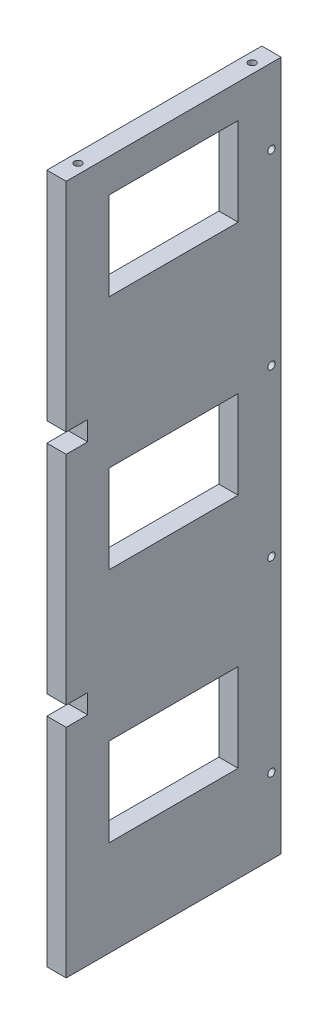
ISO-10303-21;
HEADER;
FILE_DESCRIPTION(('STEP AP214'),'2;1');
FILE_NAME('part.step','',(''),(''),'','','');
FILE_SCHEMA(('AUTOMOTIVE_DESIGN { 1 0 10303 214 1 1 1 1 }'));
ENDSEC;
DATA;
#1=APPLICATION_CONTEXT('core data for automotive mechanical design processes');
#2=APPLICATION_PROTOCOL_DEFINITION('international standard','automotive_design',2000,#1);
#3=PRODUCT_CONTEXT('',#1,'mechanical');
#4=PRODUCT('Part','Part','',(#3));
#5=PRODUCT_RELATED_PRODUCT_CATEGORY('part','',(#4));
#6=PRODUCT_DEFINITION_FORMATION('','',#4);
#7=PRODUCT_DEFINITION_CONTEXT('part definition',#1,'design');
#8=PRODUCT_DEFINITION('design','',#6,#7);
#9=PRODUCT_DEFINITION_SHAPE('','',#8);
#10=(LENGTH_UNIT() NAMED_UNIT(*) SI_UNIT(.MILLI.,.METRE.));
#11=(NAMED_UNIT(*) PLANE_ANGLE_UNIT() SI_UNIT($,.RADIAN.));
#12=(NAMED_UNIT(*) SI_UNIT($,.STERADIAN.) SOLID_ANGLE_UNIT());
#13=UNCERTAINTY_MEASURE_WITH_UNIT(LENGTH_MEASURE(1.E-05),#10,'distance_accuracy_value','');
#14=(GEOMETRIC_REPRESENTATION_CONTEXT(3) GLOBAL_UNCERTAINTY_ASSIGNED_CONTEXT((#13)) GLOBAL_UNIT_ASSIGNED_CONTEXT((#10,
#11,#12)) REPRESENTATION_CONTEXT('',''));
#15=CARTESIAN_POINT('',(0.,0.,0.));
#16=DIRECTION('',(0.,0.,1.));
#17=DIRECTION('',(1.,0.,0.));
#18=AXIS2_PLACEMENT_3D('',#15,#16,#17);
#19=CARTESIAN_POINT('',(-34.9999999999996,8.99999999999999,150.));
#20=DIRECTION('',(0.,0.,-1.));
#21=DIRECTION('',(-1.,0.,0.));
#22=AXIS2_PLACEMENT_3D('',#19,#20,#21);
#23=PLANE('',#22);
#24=DIRECTION('',(0.,-1.,0.));
#25=VECTOR('',#24,1.);
#26=CARTESIAN_POINT('',(-34.9999999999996,8.99999999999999,150.));
#27=LINE('',#26,#25);
#28=CARTESIAN_POINT('',(-34.9999999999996,220.,150.));
#29=VERTEX_POINT('',#28);
#30=CARTESIAN_POINT('',(-34.9999999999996,119.,150.));
#31=VERTEX_POINT('',#30);
#32=EDGE_CURVE('E147',#29,#31,#27,.T.);
#33=ORIENTED_EDGE('',*,*,#32,.F.);
#34=DIRECTION('',(-1.,0.,0.));
#35=VECTOR('',#34,1.);
#36=CARTESIAN_POINT('',(66.0000000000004,220.,149.999999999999));
#37=LINE('',#36,#35);
#38=CARTESIAN_POINT('',(-43.9999999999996,220.,150.));
#39=VERTEX_POINT('',#38);
#40=EDGE_CURVE('E302',#29,#39,#37,.T.);
#41=ORIENTED_EDGE('',*,*,#40,.T.);
#42=DIRECTION('',(0.,-1.,0.));
#43=VECTOR('',#42,1.);
#44=CARTESIAN_POINT('',(-43.9999999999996,8.99999999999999,150.));
#45=LINE('',#44,#43);
#46=CARTESIAN_POINT('',(-43.9999999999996,119.,150.));
#47=VERTEX_POINT('',#46);
#48=EDGE_CURVE('E133',#39,#47,#45,.T.);
#49=ORIENTED_EDGE('',*,*,#48,.T.);
#50=DIRECTION('',(1.,0.,0.));
#51=VECTOR('',#50,1.);
#52=CARTESIAN_POINT('',(-43.9999999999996,119.,150.));
#53=LINE('',#52,#51);
#54=EDGE_CURVE('E290',#47,#31,#53,.T.);
#55=ORIENTED_EDGE('',*,*,#54,.T.);
#56=EDGE_LOOP('',(#33,#41,#49,#55));
#57=FACE_BOUND('',#56,.T.);
#58=ADVANCED_FACE('F35',(#57),#23,.F.);
#59=CARTESIAN_POINT('',(-34.9999999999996,110.,150.));
#60=VERTEX_POINT('',#59);
#61=CARTESIAN_POINT('',(-34.9999999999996,8.99999999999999,150.));
#62=VERTEX_POINT('',#61);
#63=EDGE_CURVE('E148',#60,#62,#27,.T.);
#64=ORIENTED_EDGE('',*,*,#63,.F.);
#65=DIRECTION('',(-1.,0.,0.));
#66=VECTOR('',#65,1.);
#67=CARTESIAN_POINT('',(56.0000000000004,110.,149.999999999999));
#68=LINE('',#67,#66);
#69=CARTESIAN_POINT('',(-43.9999999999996,110.,150.));
#70=VERTEX_POINT('',#69);
#71=EDGE_CURVE('E283',#60,#70,#68,.T.);
#72=ORIENTED_EDGE('',*,*,#71,.T.);
#73=CARTESIAN_POINT('',(-43.9999999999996,8.99999999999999,150.));
#74=VERTEX_POINT('',#73);
#75=EDGE_CURVE('E134',#70,#74,#45,.T.);
#76=ORIENTED_EDGE('',*,*,#75,.T.);
#77=DIRECTION('',(-1.,0.,0.));
#78=VECTOR('',#77,1.);
#79=CARTESIAN_POINT('',(-34.9999999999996,8.99999999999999,150.));
#80=LINE('',#79,#78);
#81=EDGE_CURVE('E119',#62,#74,#80,.T.);
#82=ORIENTED_EDGE('',*,*,#81,.F.);
#83=EDGE_LOOP('',(#64,#72,#76,#82));
#84=FACE_BOUND('',#83,.T.);
#85=ADVANCED_FACE('F534',(#84),#23,.F.);
#86=CARTESIAN_POINT('',(-35.0000000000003,9.,49.9999999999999));
#87=DIRECTION('',(0.,0.,1.));
#88=DIRECTION('',(1.,0.,0.));
#89=AXIS2_PLACEMENT_3D('',#86,#87,#88);
#90=PLANE('',#89);
#91=DIRECTION('',(0.,1.,0.));
#92=VECTOR('',#91,1.);
#93=CARTESIAN_POINT('',(-44.0000000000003,9.,50.));
#94=LINE('',#93,#92);
#95=CARTESIAN_POINT('',(-44.0000000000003,9.,50.));
#96=VERTEX_POINT('',#95);
#97=CARTESIAN_POINT('',(-44.0000000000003,330.,50.));
#98=VERTEX_POINT('',#97);
#99=EDGE_CURVE('E138',#96,#98,#94,.T.);
#100=ORIENTED_EDGE('',*,*,#99,.T.);
#101=DIRECTION('',(-1.,0.,0.));
#102=VECTOR('',#101,1.);
#103=CARTESIAN_POINT('',(-35.0000000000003,330.,49.9999999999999));
#104=LINE('',#103,#102);
#105=CARTESIAN_POINT('',(-35.0000000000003,330.,49.9999999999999));
#106=VERTEX_POINT('',#105);
#107=EDGE_CURVE('E12',#106,#98,#104,.T.);
#108=ORIENTED_EDGE('',*,*,#107,.F.);
#109=DIRECTION('',(0.,1.,0.));
#110=VECTOR('',#109,1.);
#111=CARTESIAN_POINT('',(-35.0000000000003,9.,49.9999999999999));
#112=LINE('',#111,#110);
#113=CARTESIAN_POINT('',(-35.0000000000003,9.,49.9999999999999));
#114=VERTEX_POINT('',#113);
#115=EDGE_CURVE('E129',#114,#106,#112,.T.);
#116=ORIENTED_EDGE('',*,*,#115,.F.);
#117=DIRECTION('',(-1.,0.,0.));
#118=VECTOR('',#117,1.);
#119=CARTESIAN_POINT('',(-35.0000000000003,9.,49.9999999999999));
#120=LINE('',#119,#118);
#121=EDGE_CURVE('E122',#114,#96,#120,.T.);
#122=ORIENTED_EDGE('',*,*,#121,.T.);
#123=EDGE_LOOP('',(#100,#108,#116,#122));
#124=FACE_BOUND('',#123,.T.);
#125=ADVANCED_FACE('F525',(#124),#90,.F.);
#126=CARTESIAN_POINT('',(-35.0000000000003,330.,49.9999999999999));
#127=DIRECTION('',(0.,-1.,0.));
#128=DIRECTION('',(0.,0.,1.));
#129=AXIS2_PLACEMENT_3D('',#126,#127,#128);
#130=PLANE('',#129);
#131=CARTESIAN_POINT('',(-39.4999999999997,330.,140.));
#132=DIRECTION('',(0.,-1.,0.));
#133=DIRECTION('',(0.,0.,1.));
#134=AXIS2_PLACEMENT_3D('',#131,#132,#133);
#135=CIRCLE('',#134,1.69999999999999);
#136=CARTESIAN_POINT('',(-39.4999999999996,330.,141.7));
#137=VERTEX_POINT('',#136);
#138=EDGE_CURVE('E87',#137,#137,#135,.T.);
#139=ORIENTED_EDGE('',*,*,#138,.T.);
#140=EDGE_LOOP('',(#139));
#141=FACE_BOUND('',#140,.T.);
#142=CARTESIAN_POINT('',(-39.5000000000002,330.,59.));
#143=DIRECTION('',(0.,-1.,0.));
#144=DIRECTION('',(0.,0.,1.));
#145=AXIS2_PLACEMENT_3D('',#142,#143,#144);
#146=CIRCLE('',#145,1.69999999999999);
#147=CARTESIAN_POINT('',(-39.5000000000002,330.,60.7));
#148=VERTEX_POINT('',#147);
#149=EDGE_CURVE('E113',#148,#148,#146,.T.);
#150=ORIENTED_EDGE('',*,*,#149,.T.);
#151=EDGE_LOOP('',(#150));
#152=FACE_BOUND('',#151,.T.);
#153=DIRECTION('',(0.,0.,1.));
#154=VECTOR('',#153,1.);
#155=CARTESIAN_POINT('',(-44.0000000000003,330.,50.));
#156=LINE('',#155,#154);
#157=CARTESIAN_POINT('',(-43.9999999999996,330.,150.));
#158=VERTEX_POINT('',#157);
#159=EDGE_CURVE('E135',#98,#158,#156,.T.);
#160=ORIENTED_EDGE('',*,*,#159,.T.);
#161=DIRECTION('',(-1.,0.,0.));
#162=VECTOR('',#161,1.);
#163=CARTESIAN_POINT('',(-34.9999999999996,330.,150.));
#164=LINE('',#163,#162);
#165=CARTESIAN_POINT('',(-34.9999999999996,330.,150.));
#166=VERTEX_POINT('',#165);
#167=EDGE_CURVE('E45',#166,#158,#164,.T.);
#168=ORIENTED_EDGE('',*,*,#167,.F.);
#169=DIRECTION('',(0.,0.,1.));
#170=VECTOR('',#169,1.);
#171=CARTESIAN_POINT('',(-35.0000000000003,330.,49.9999999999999));
#172=LINE('',#171,#170);
#173=EDGE_CURVE('E149',#106,#166,#172,.T.);
#174=ORIENTED_EDGE('',*,*,#173,.F.);
#175=ORIENTED_EDGE('',*,*,#107,.T.);
#176=EDGE_LOOP('',(#160,#168,#174,#175));
#177=FACE_BOUND('',#176,.T.);
#178=ADVANCED_FACE('F519',(#141,#152,#177),#130,.F.);
#179=CARTESIAN_POINT('',(-43.9999999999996,229.,150.));
#180=VERTEX_POINT('',#179);
#181=EDGE_CURVE('E130',#158,#180,#45,.T.);
#182=ORIENTED_EDGE('',*,*,#181,.T.);
#183=DIRECTION('',(1.,0.,0.));
#184=VECTOR('',#183,1.);
#185=CARTESIAN_POINT('',(-43.9999999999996,229.,150.));
#186=LINE('',#185,#184);
#187=CARTESIAN_POINT('',(-34.9999999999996,229.,150.));
#188=VERTEX_POINT('',#187);
#189=EDGE_CURVE('E308',#180,#188,#186,.T.);
#190=ORIENTED_EDGE('',*,*,#189,.T.);
#191=EDGE_CURVE('E144',#166,#188,#27,.T.);
#192=ORIENTED_EDGE('',*,*,#191,.F.);
#193=ORIENTED_EDGE('',*,*,#167,.T.);
#194=EDGE_LOOP('',(#182,#190,#192,#193));
#195=FACE_BOUND('',#194,.T.);
#196=ADVANCED_FACE('F516',(#195),#23,.F.);
#197=CARTESIAN_POINT('',(-35.0000000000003,9.,49.9999999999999));
#198=DIRECTION('',(0.,1.,0.));
#199=DIRECTION('',(0.,0.,-1.));
#200=AXIS2_PLACEMENT_3D('',#197,#198,#199);
#201=PLANE('',#200);
#202=CARTESIAN_POINT('',(-39.5000000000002,9.,59.));
#203=DIRECTION('',(0.,1.,0.));
#204=DIRECTION('',(0.,0.,-1.));
#205=AXIS2_PLACEMENT_3D('',#202,#203,#204);
#206=CIRCLE('',#205,1.69999999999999);
#207=CARTESIAN_POINT('',(-39.5000000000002,9.,57.3));
#208=VERTEX_POINT('',#207);
#209=EDGE_CURVE('E77',#208,#208,#206,.T.);
#210=ORIENTED_EDGE('',*,*,#209,.T.);
#211=EDGE_LOOP('',(#210));
#212=FACE_BOUND('',#211,.T.);
#213=CARTESIAN_POINT('',(-39.4999999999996,8.99999999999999,140.));
#214=DIRECTION('',(0.,1.,0.));
#215=DIRECTION('',(0.,0.,-1.));
#216=AXIS2_PLACEMENT_3D('',#213,#214,#215);
#217=CIRCLE('',#216,1.69999999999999);
#218=CARTESIAN_POINT('',(-39.4999999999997,8.99999999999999,138.3));
#219=VERTEX_POINT('',#218);
#220=EDGE_CURVE('E84',#219,#219,#217,.T.);
#221=ORIENTED_EDGE('',*,*,#220,.T.);
#222=EDGE_LOOP('',(#221));
#223=FACE_BOUND('',#222,.T.);
#224=DIRECTION('',(0.,0.,-1.));
#225=VECTOR('',#224,1.);
#226=CARTESIAN_POINT('',(-44.0000000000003,9.,50.));
#227=LINE('',#226,#225);
#228=EDGE_CURVE('E126',#74,#96,#227,.T.);
#229=ORIENTED_EDGE('',*,*,#228,.T.);
#230=ORIENTED_EDGE('',*,*,#121,.F.);
#231=DIRECTION('',(0.,0.,-1.));
#232=VECTOR('',#231,1.);
#233=CARTESIAN_POINT('',(-35.0000000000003,9.,49.9999999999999));
#234=LINE('',#233,#232);
#235=EDGE_CURVE('E125',#62,#114,#234,.T.);
#236=ORIENTED_EDGE('',*,*,#235,.F.);
#237=ORIENTED_EDGE('',*,*,#81,.T.);
#238=EDGE_LOOP('',(#229,#230,#236,#237));
#239=FACE_BOUND('',#238,.T.);
#240=ADVANCED_FACE('F530',(#212,#223,#239),#201,.F.);
#241=CARTESIAN_POINT('',(-34.9999999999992,0.,200.));
#242=DIRECTION('',(1.,0.,0.));
#243=DIRECTION('',(0.,0.,-1.));
#244=AXIS2_PLACEMENT_3D('',#241,#242,#243);
#245=PLANE('',#244);
#246=CARTESIAN_POINT('',(-35.0000000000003,295.,54.4999999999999));
#247=DIRECTION('',(1.,0.,0.));
#248=DIRECTION('',(0.,0.,-1.));
#249=AXIS2_PLACEMENT_3D('',#246,#247,#248);
#250=CIRCLE('',#249,1.69999999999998);
#251=CARTESIAN_POINT('',(-35.0000000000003,295.,52.8));
#252=VERTEX_POINT('',#251);
#253=EDGE_CURVE('E93',#252,#252,#250,.T.);
#254=ORIENTED_EDGE('',*,*,#253,.F.);
#255=EDGE_LOOP('',(#254));
#256=FACE_BOUND('',#255,.T.);
#257=CARTESIAN_POINT('',(-35.0000000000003,208.,54.4999999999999));
#258=DIRECTION('',(1.,0.,0.));
#259=DIRECTION('',(0.,0.,-1.));
#260=AXIS2_PLACEMENT_3D('',#257,#258,#259);
#261=CIRCLE('',#260,1.70000000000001);
#262=CARTESIAN_POINT('',(-35.0000000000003,208.,52.7999999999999));
#263=VERTEX_POINT('',#262);
#264=EDGE_CURVE('E98',#263,#263,#261,.T.);
#265=ORIENTED_EDGE('',*,*,#264,.F.);
#266=EDGE_LOOP('',(#265));
#267=FACE_BOUND('',#266,.T.);
#268=CARTESIAN_POINT('',(-35.0000000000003,131.,54.4999999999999));
#269=DIRECTION('',(1.,0.,0.));
#270=DIRECTION('',(0.,0.,-1.));
#271=AXIS2_PLACEMENT_3D('',#268,#269,#270);
#272=CIRCLE('',#271,1.69999999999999);
#273=CARTESIAN_POINT('',(-35.0000000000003,131.,52.7999999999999));
#274=VERTEX_POINT('',#273);
#275=EDGE_CURVE('E103',#274,#274,#272,.T.);
#276=ORIENTED_EDGE('',*,*,#275,.F.);
#277=EDGE_LOOP('',(#276));
#278=FACE_BOUND('',#277,.T.);
#279=CARTESIAN_POINT('',(-35.0000000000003,44.,54.4999999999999));
#280=DIRECTION('',(1.,0.,0.));
#281=DIRECTION('',(0.,0.,-1.));
#282=AXIS2_PLACEMENT_3D('',#279,#280,#281);
#283=CIRCLE('',#282,1.69999999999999);
#284=CARTESIAN_POINT('',(-35.0000000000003,44.,52.7999999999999));
#285=VERTEX_POINT('',#284);
#286=EDGE_CURVE('E88',#285,#285,#283,.T.);
#287=ORIENTED_EDGE('',*,*,#286,.F.);
#288=EDGE_LOOP('',(#287));
#289=FACE_BOUND('',#288,.T.);
#290=DIRECTION('',(0.,0.,-1.));
#291=VECTOR('',#290,1.);
#292=CARTESIAN_POINT('',(-34.9999999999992,220.,200.));
#293=LINE('',#292,#291);
#294=CARTESIAN_POINT('',(-34.9999999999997,220.,140.));
#295=VERTEX_POINT('',#294);
#296=EDGE_CURVE('E199',#29,#295,#293,.T.);
#297=ORIENTED_EDGE('',*,*,#296,.F.);
#298=ORIENTED_EDGE('',*,*,#32,.T.);
#299=DIRECTION('',(0.,0.,1.));
#300=VECTOR('',#299,1.);
#301=CARTESIAN_POINT('',(-34.9999999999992,119.,200.));
#302=LINE('',#301,#300);
#303=CARTESIAN_POINT('',(-34.9999999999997,119.,140.));
#304=VERTEX_POINT('',#303);
#305=EDGE_CURVE('E272',#304,#31,#302,.T.);
#306=ORIENTED_EDGE('',*,*,#305,.F.);
#307=DIRECTION('',(0.,1.,0.));
#308=VECTOR('',#307,1.);
#309=CARTESIAN_POINT('',(-34.9999999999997,0.,140.));
#310=LINE('',#309,#308);
#311=CARTESIAN_POINT('',(-34.9999999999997,110.,140.));
#312=VERTEX_POINT('',#311);
#313=EDGE_CURVE('E275',#312,#304,#310,.T.);
#314=ORIENTED_EDGE('',*,*,#313,.F.);
#315=DIRECTION('',(0.,0.,-1.));
#316=VECTOR('',#315,1.);
#317=CARTESIAN_POINT('',(-34.9999999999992,110.,200.));
#318=LINE('',#317,#316);
#319=EDGE_CURVE('E269',#60,#312,#318,.T.);
#320=ORIENTED_EDGE('',*,*,#319,.F.);
#321=ORIENTED_EDGE('',*,*,#63,.T.);
#322=ORIENTED_EDGE('',*,*,#235,.T.);
#323=ORIENTED_EDGE('',*,*,#115,.T.);
#324=ORIENTED_EDGE('',*,*,#173,.T.);
#325=ORIENTED_EDGE('',*,*,#191,.T.);
#326=DIRECTION('',(0.,0.,1.));
#327=VECTOR('',#326,1.);
#328=CARTESIAN_POINT('',(-34.9999999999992,229.,200.));
#329=LINE('',#328,#327);
#330=CARTESIAN_POINT('',(-34.9999999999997,229.,140.));
#331=VERTEX_POINT('',#330);
#332=EDGE_CURVE('E264',#331,#188,#329,.T.);
#333=ORIENTED_EDGE('',*,*,#332,.F.);
#334=DIRECTION('',(0.,1.,0.));
#335=VECTOR('',#334,1.);
#336=CARTESIAN_POINT('',(-34.9999999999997,0.,140.));
#337=LINE('',#336,#335);
#338=EDGE_CURVE('E267',#295,#331,#337,.T.);
#339=ORIENTED_EDGE('',*,*,#338,.F.);
#340=EDGE_LOOP('',(#297,#298,#306,#314,#320,#321,#322,#323,#324,#325,#333,#339));
#341=FACE_BOUND('',#340,.T.);
#342=DIRECTION('',(0.,-1.,0.));
#343=VECTOR('',#342,1.);
#344=CARTESIAN_POINT('',(-34.9999999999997,0.,130.));
#345=LINE('',#344,#343);
#346=CARTESIAN_POINT('',(-34.9999999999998,94.5,130.));
#347=VERTEX_POINT('',#346);
#348=CARTESIAN_POINT('',(-34.9999999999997,53.5,130.));
#349=VERTEX_POINT('',#348);
#350=EDGE_CURVE('E141',#347,#349,#345,.T.);
#351=ORIENTED_EDGE('',*,*,#350,.F.);
#352=DIRECTION('',(0.,0.,1.));
#353=VECTOR('',#352,1.);
#354=CARTESIAN_POINT('',(-34.9999999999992,94.5,200.));
#355=LINE('',#354,#353);
#356=CARTESIAN_POINT('',(-35.0000000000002,94.5,70.));
#357=VERTEX_POINT('',#356);
#358=EDGE_CURVE('E156',#357,#347,#355,.T.);
#359=ORIENTED_EDGE('',*,*,#358,.F.);
#360=DIRECTION('',(0.,1.,0.));
#361=VECTOR('',#360,1.);
#362=CARTESIAN_POINT('',(-35.0000000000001,0.,69.9999999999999));
#363=LINE('',#362,#361);
#364=CARTESIAN_POINT('',(-35.0000000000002,53.5,69.9999999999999));
#365=VERTEX_POINT('',#364);
#366=EDGE_CURVE('E159',#365,#357,#363,.T.);
#367=ORIENTED_EDGE('',*,*,#366,.F.);
#368=DIRECTION('',(0.,0.,-1.));
#369=VECTOR('',#368,1.);
#370=CARTESIAN_POINT('',(-34.9999999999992,53.5,200.));
#371=LINE('',#370,#369);
#372=EDGE_CURVE('E162',#349,#365,#371,.T.);
#373=ORIENTED_EDGE('',*,*,#372,.F.);
#374=EDGE_LOOP('',(#351,#359,#367,#373));
#375=FACE_BOUND('',#374,.T.);
#376=DIRECTION('',(0.,0.,1.));
#377=VECTOR('',#376,1.);
#378=CARTESIAN_POINT('',(-34.9999999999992,204.5,200.));
#379=LINE('',#378,#377);
#380=CARTESIAN_POINT('',(-35.0000000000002,204.5,70.));
#381=VERTEX_POINT('',#380);
#382=CARTESIAN_POINT('',(-34.9999999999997,204.5,130.));
#383=VERTEX_POINT('',#382);
#384=EDGE_CURVE('E165',#381,#383,#379,.T.);
#385=ORIENTED_EDGE('',*,*,#384,.F.);
#386=DIRECTION('',(0.,1.,0.));
#387=VECTOR('',#386,1.);
#388=CARTESIAN_POINT('',(-35.0000000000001,0.,69.9999999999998));
#389=LINE('',#388,#387);
#390=CARTESIAN_POINT('',(-35.0000000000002,163.5,69.9999999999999));
#391=VERTEX_POINT('',#390);
#392=EDGE_CURVE('E168',#391,#381,#389,.T.);
#393=ORIENTED_EDGE('',*,*,#392,.F.);
#394=DIRECTION('',(0.,0.,-1.));
#395=VECTOR('',#394,1.);
#396=CARTESIAN_POINT('',(-34.9999999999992,163.5,200.));
#397=LINE('',#396,#395);
#398=CARTESIAN_POINT('',(-34.9999999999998,163.5,130.));
#399=VERTEX_POINT('',#398);
#400=EDGE_CURVE('E171',#399,#391,#397,.T.);
#401=ORIENTED_EDGE('',*,*,#400,.F.);
#402=DIRECTION('',(0.,-1.,0.));
#403=VECTOR('',#402,1.);
#404=CARTESIAN_POINT('',(-34.9999999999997,0.,130.));
#405=LINE('',#404,#403);
#406=EDGE_CURVE('E174',#383,#399,#405,.T.);
#407=ORIENTED_EDGE('',*,*,#406,.F.);
#408=EDGE_LOOP('',(#385,#393,#401,#407));
#409=FACE_BOUND('',#408,.T.);
#410=DIRECTION('',(0.,0.,1.));
#411=VECTOR('',#410,1.);
#412=CARTESIAN_POINT('',(-34.9999999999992,314.5,200.));
#413=LINE('',#412,#411);
#414=CARTESIAN_POINT('',(-35.0000000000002,314.5,69.9999999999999));
#415=VERTEX_POINT('',#414);
#416=CARTESIAN_POINT('',(-34.9999999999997,314.5,130.));
#417=VERTEX_POINT('',#416);
#418=EDGE_CURVE('E177',#415,#417,#413,.T.);
#419=ORIENTED_EDGE('',*,*,#418,.F.);
#420=DIRECTION('',(0.,1.,0.));
#421=VECTOR('',#420,1.);
#422=CARTESIAN_POINT('',(-35.0000000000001,0.,69.9999999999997));
#423=LINE('',#422,#421);
#424=CARTESIAN_POINT('',(-35.0000000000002,273.5,69.9999999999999));
#425=VERTEX_POINT('',#424);
#426=EDGE_CURVE('E180',#425,#415,#423,.T.);
#427=ORIENTED_EDGE('',*,*,#426,.F.);
#428=DIRECTION('',(0.,0.,-1.));
#429=VECTOR('',#428,1.);
#430=CARTESIAN_POINT('',(-34.9999999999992,273.5,200.));
#431=LINE('',#430,#429);
#432=CARTESIAN_POINT('',(-34.9999999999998,273.5,130.));
#433=VERTEX_POINT('',#432);
#434=EDGE_CURVE('E183',#433,#425,#431,.T.);
#435=ORIENTED_EDGE('',*,*,#434,.F.);
#436=DIRECTION('',(0.,-1.,0.));
#437=VECTOR('',#436,1.);
#438=CARTESIAN_POINT('',(-34.9999999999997,0.,130.));
#439=LINE('',#438,#437);
#440=EDGE_CURVE('E186',#417,#433,#439,.T.);
#441=ORIENTED_EDGE('',*,*,#440,.F.);
#442=EDGE_LOOP('',(#419,#427,#435,#441));
#443=FACE_BOUND('',#442,.T.);
#444=ADVANCED_FACE('F351',(#256,#267,#278,#289,#341,#375,#409,#443),#245,.T.);
#445=CARTESIAN_POINT('',(-43.9999999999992,0.,200.));
#446=DIRECTION('',(1.,0.,0.));
#447=DIRECTION('',(0.,0.,-1.));
#448=AXIS2_PLACEMENT_3D('',#445,#446,#447);
#449=PLANE('',#448);
#450=CARTESIAN_POINT('',(-44.0000000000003,295.,54.5));
#451=DIRECTION('',(-1.,0.,0.));
#452=DIRECTION('',(0.,0.,1.));
#453=AXIS2_PLACEMENT_3D('',#450,#451,#452);
#454=CIRCLE('',#453,3.5);
#455=CARTESIAN_POINT('',(-44.0000000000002,295.,58.));
#456=VERTEX_POINT('',#455);
#457=EDGE_CURVE('E92',#456,#456,#454,.T.);
#458=ORIENTED_EDGE('',*,*,#457,.F.);
#459=EDGE_LOOP('',(#458));
#460=FACE_BOUND('',#459,.T.);
#461=CARTESIAN_POINT('',(-44.0000000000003,208.,54.5));
#462=DIRECTION('',(-1.,0.,0.));
#463=DIRECTION('',(0.,0.,1.));
#464=AXIS2_PLACEMENT_3D('',#461,#462,#463);
#465=CIRCLE('',#464,3.5);
#466=CARTESIAN_POINT('',(-44.0000000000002,208.,58.));
#467=VERTEX_POINT('',#466);
#468=EDGE_CURVE('E96',#467,#467,#465,.T.);
#469=ORIENTED_EDGE('',*,*,#468,.F.);
#470=EDGE_LOOP('',(#469));
#471=FACE_BOUND('',#470,.T.);
#472=CARTESIAN_POINT('',(-44.0000000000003,131.,54.5));
#473=DIRECTION('',(-1.,0.,0.));
#474=DIRECTION('',(0.,0.,1.));
#475=AXIS2_PLACEMENT_3D('',#472,#473,#474);
#476=CIRCLE('',#475,3.5);
#477=CARTESIAN_POINT('',(-44.0000000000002,131.,58.));
#478=VERTEX_POINT('',#477);
#479=EDGE_CURVE('E101',#478,#478,#476,.T.);
#480=ORIENTED_EDGE('',*,*,#479,.F.);
#481=EDGE_LOOP('',(#480));
#482=FACE_BOUND('',#481,.T.);
#483=CARTESIAN_POINT('',(-44.0000000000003,44.,54.5));
#484=DIRECTION('',(-1.,0.,0.));
#485=DIRECTION('',(0.,0.,1.));
#486=AXIS2_PLACEMENT_3D('',#483,#484,#485);
#487=CIRCLE('',#486,3.5);
#488=CARTESIAN_POINT('',(-44.0000000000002,44.,58.));
#489=VERTEX_POINT('',#488);
#490=EDGE_CURVE('E106',#489,#489,#487,.T.);
#491=ORIENTED_EDGE('',*,*,#490,.F.);
#492=EDGE_LOOP('',(#491));
#493=FACE_BOUND('',#492,.T.);
#494=ORIENTED_EDGE('',*,*,#48,.F.);
#495=DIRECTION('',(0.,0.,-1.));
#496=VECTOR('',#495,1.);
#497=CARTESIAN_POINT('',(-43.9999999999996,220.,150.));
#498=LINE('',#497,#496);
#499=CARTESIAN_POINT('',(-43.9999999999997,220.,140.));
#500=VERTEX_POINT('',#499);
#501=EDGE_CURVE('E278',#39,#500,#498,.T.);
#502=ORIENTED_EDGE('',*,*,#501,.T.);
#503=DIRECTION('',(0.,1.,0.));
#504=VECTOR('',#503,1.);
#505=CARTESIAN_POINT('',(-43.9999999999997,220.,140.));
#506=LINE('',#505,#504);
#507=CARTESIAN_POINT('',(-43.9999999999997,229.,140.));
#508=VERTEX_POINT('',#507);
#509=EDGE_CURVE('E286',#500,#508,#506,.T.);
#510=ORIENTED_EDGE('',*,*,#509,.T.);
#511=DIRECTION('',(0.,0.,-1.));
#512=VECTOR('',#511,1.);
#513=CARTESIAN_POINT('',(-43.9999999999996,229.,150.));
#514=LINE('',#513,#512);
#515=EDGE_CURVE('E300',#180,#508,#514,.T.);
#516=ORIENTED_EDGE('',*,*,#515,.F.);
#517=ORIENTED_EDGE('',*,*,#181,.F.);
#518=ORIENTED_EDGE('',*,*,#159,.F.);
#519=ORIENTED_EDGE('',*,*,#99,.F.);
#520=ORIENTED_EDGE('',*,*,#228,.F.);
#521=ORIENTED_EDGE('',*,*,#75,.F.);
#522=DIRECTION('',(0.,0.,-1.));
#523=VECTOR('',#522,1.);
#524=CARTESIAN_POINT('',(-43.9999999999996,110.,150.));
#525=LINE('',#524,#523);
#526=CARTESIAN_POINT('',(-43.9999999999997,110.,140.));
#527=VERTEX_POINT('',#526);
#528=EDGE_CURVE('E282',#70,#527,#525,.T.);
#529=ORIENTED_EDGE('',*,*,#528,.T.);
#530=DIRECTION('',(0.,1.,0.));
#531=VECTOR('',#530,1.);
#532=CARTESIAN_POINT('',(-43.9999999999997,110.,140.));
#533=LINE('',#532,#531);
#534=CARTESIAN_POINT('',(-43.9999999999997,119.,140.));
#535=VERTEX_POINT('',#534);
#536=EDGE_CURVE('E115',#527,#535,#533,.T.);
#537=ORIENTED_EDGE('',*,*,#536,.T.);
#538=DIRECTION('',(0.,0.,-1.));
#539=VECTOR('',#538,1.);
#540=CARTESIAN_POINT('',(-43.9999999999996,119.,150.));
#541=LINE('',#540,#539);
#542=EDGE_CURVE('E279',#47,#535,#541,.T.);
#543=ORIENTED_EDGE('',*,*,#542,.F.);
#544=EDGE_LOOP('',(#494,#502,#510,#516,#517,#518,#519,#520,#521,#529,#537,#543));
#545=FACE_BOUND('',#544,.T.);
#546=DIRECTION('',(0.,0.,-1.));
#547=VECTOR('',#546,1.);
#548=CARTESIAN_POINT('',(-43.9999999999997,94.5,130.));
#549=LINE('',#548,#547);
#550=CARTESIAN_POINT('',(-43.9999999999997,94.5,130.));
#551=VERTEX_POINT('',#550);
#552=CARTESIAN_POINT('',(-44.0000000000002,94.5,70.));
#553=VERTEX_POINT('',#552);
#554=EDGE_CURVE('E257',#551,#553,#549,.T.);
#555=ORIENTED_EDGE('',*,*,#554,.F.);
#556=DIRECTION('',(0.,1.,0.));
#557=VECTOR('',#556,1.);
#558=CARTESIAN_POINT('',(-43.9999999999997,94.5,130.));
#559=LINE('',#558,#557);
#560=CARTESIAN_POINT('',(-43.9999999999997,53.5,130.));
#561=VERTEX_POINT('',#560);
#562=EDGE_CURVE('E242',#561,#551,#559,.T.);
#563=ORIENTED_EDGE('',*,*,#562,.F.);
#564=DIRECTION('',(0.,0.,1.));
#565=VECTOR('',#564,1.);
#566=CARTESIAN_POINT('',(-43.9999999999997,53.5,130.));
#567=LINE('',#566,#565);
#568=CARTESIAN_POINT('',(-44.0000000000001,53.5,70.));
#569=VERTEX_POINT('',#568);
#570=EDGE_CURVE('E189',#569,#561,#567,.T.);
#571=ORIENTED_EDGE('',*,*,#570,.F.);
#572=DIRECTION('',(0.,-1.,0.));
#573=VECTOR('',#572,1.);
#574=CARTESIAN_POINT('',(-44.0000000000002,94.5,70.));
#575=LINE('',#574,#573);
#576=EDGE_CURVE('E254',#553,#569,#575,.T.);
#577=ORIENTED_EDGE('',*,*,#576,.F.);
#578=EDGE_LOOP('',(#555,#563,#571,#577));
#579=FACE_BOUND('',#578,.T.);
#580=DIRECTION('',(0.,-1.,0.));
#581=VECTOR('',#580,1.);
#582=CARTESIAN_POINT('',(-44.0000000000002,204.5,70.));
#583=LINE('',#582,#581);
#584=CARTESIAN_POINT('',(-44.0000000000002,204.5,70.));
#585=VERTEX_POINT('',#584);
#586=CARTESIAN_POINT('',(-44.0000000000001,163.5,70.));
#587=VERTEX_POINT('',#586);
#588=EDGE_CURVE('E235',#585,#587,#583,.T.);
#589=ORIENTED_EDGE('',*,*,#588,.F.);
#590=DIRECTION('',(0.,0.,-1.));
#591=VECTOR('',#590,1.);
#592=CARTESIAN_POINT('',(-43.9999999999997,204.5,130.));
#593=LINE('',#592,#591);
#594=CARTESIAN_POINT('',(-43.9999999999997,204.5,130.));
#595=VERTEX_POINT('',#594);
#596=EDGE_CURVE('E220',#595,#585,#593,.T.);
#597=ORIENTED_EDGE('',*,*,#596,.F.);
#598=DIRECTION('',(0.,1.,0.));
#599=VECTOR('',#598,1.);
#600=CARTESIAN_POINT('',(-43.9999999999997,204.5,130.));
#601=LINE('',#600,#599);
#602=CARTESIAN_POINT('',(-43.9999999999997,163.5,130.));
#603=VERTEX_POINT('',#602);
#604=EDGE_CURVE('E216',#603,#595,#601,.T.);
#605=ORIENTED_EDGE('',*,*,#604,.F.);
#606=DIRECTION('',(0.,0.,1.));
#607=VECTOR('',#606,1.);
#608=CARTESIAN_POINT('',(-43.9999999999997,163.5,130.));
#609=LINE('',#608,#607);
#610=EDGE_CURVE('E232',#587,#603,#609,.T.);
#611=ORIENTED_EDGE('',*,*,#610,.F.);
#612=EDGE_LOOP('',(#589,#597,#605,#611));
#613=FACE_BOUND('',#612,.T.);
#614=DIRECTION('',(0.,-1.,0.));
#615=VECTOR('',#614,1.);
#616=CARTESIAN_POINT('',(-44.0000000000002,314.5,70.));
#617=LINE('',#616,#615);
#618=CARTESIAN_POINT('',(-44.0000000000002,314.5,70.));
#619=VERTEX_POINT('',#618);
#620=CARTESIAN_POINT('',(-44.0000000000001,273.5,70.));
#621=VERTEX_POINT('',#620);
#622=EDGE_CURVE('E211',#619,#621,#617,.T.);
#623=ORIENTED_EDGE('',*,*,#622,.F.);
#624=DIRECTION('',(0.,0.,-1.));
#625=VECTOR('',#624,1.);
#626=CARTESIAN_POINT('',(-43.9999999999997,314.5,130.));
#627=LINE('',#626,#625);
#628=CARTESIAN_POINT('',(-43.9999999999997,314.5,130.));
#629=VERTEX_POINT('',#628);
#630=EDGE_CURVE('E194',#629,#619,#627,.T.);
#631=ORIENTED_EDGE('',*,*,#630,.F.);
#632=DIRECTION('',(0.,1.,0.));
#633=VECTOR('',#632,1.);
#634=CARTESIAN_POINT('',(-43.9999999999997,314.5,130.));
#635=LINE('',#634,#633);
#636=CARTESIAN_POINT('',(-43.9999999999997,273.5,130.));
#637=VERTEX_POINT('',#636);
#638=EDGE_CURVE('E190',#637,#629,#635,.T.);
#639=ORIENTED_EDGE('',*,*,#638,.F.);
#640=DIRECTION('',(0.,0.,1.));
#641=VECTOR('',#640,1.);
#642=CARTESIAN_POINT('',(-43.9999999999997,273.5,130.));
#643=LINE('',#642,#641);
#644=EDGE_CURVE('E208',#621,#637,#643,.T.);
#645=ORIENTED_EDGE('',*,*,#644,.F.);
#646=EDGE_LOOP('',(#623,#631,#639,#645));
#647=FACE_BOUND('',#646,.T.);
#648=ADVANCED_FACE('F347',(#460,#471,#482,#493,#545,#579,#613,#647),#449,.F.);
#649=CARTESIAN_POINT('',(-116.670489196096,314.5,130.));
#650=DIRECTION('',(0.,1.,0.));
#651=DIRECTION('',(0.,0.,-1.));
#652=AXIS2_PLACEMENT_3D('',#649,#650,#651);
#653=PLANE('',#652);
#654=ORIENTED_EDGE('',*,*,#418,.T.);
#655=DIRECTION('',(1.,0.,0.));
#656=VECTOR('',#655,1.);
#657=CARTESIAN_POINT('',(-116.670489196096,314.5,130.));
#658=LINE('',#657,#656);
#659=EDGE_CURVE('E195',#629,#417,#658,.T.);
#660=ORIENTED_EDGE('',*,*,#659,.F.);
#661=ORIENTED_EDGE('',*,*,#630,.T.);
#662=DIRECTION('',(1.,0.,0.));
#663=VECTOR('',#662,1.);
#664=CARTESIAN_POINT('',(-116.670489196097,314.5,70.0000000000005));
#665=LINE('',#664,#663);
#666=EDGE_CURVE('E205',#619,#415,#665,.T.);
#667=ORIENTED_EDGE('',*,*,#666,.T.);
#668=EDGE_LOOP('',(#654,#660,#661,#667));
#669=FACE_BOUND('',#668,.T.);
#670=ADVANCED_FACE('F350',(#669),#653,.F.);
#671=CARTESIAN_POINT('',(-116.670489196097,314.5,70.0000000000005));
#672=DIRECTION('',(0.,0.,-1.));
#673=DIRECTION('',(0.,-1.,0.));
#674=AXIS2_PLACEMENT_3D('',#671,#672,#673);
#675=PLANE('',#674);
#676=ORIENTED_EDGE('',*,*,#426,.T.);
#677=ORIENTED_EDGE('',*,*,#666,.F.);
#678=ORIENTED_EDGE('',*,*,#622,.T.);
#679=DIRECTION('',(1.,0.,0.));
#680=VECTOR('',#679,1.);
#681=CARTESIAN_POINT('',(-116.670489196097,273.5,70.0000000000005));
#682=LINE('',#681,#680);
#683=EDGE_CURVE('E202',#621,#425,#682,.T.);
#684=ORIENTED_EDGE('',*,*,#683,.T.);
#685=EDGE_LOOP('',(#676,#677,#678,#684));
#686=FACE_BOUND('',#685,.T.);
#687=ADVANCED_FACE('F385',(#686),#675,.F.);
#688=CARTESIAN_POINT('',(-116.670489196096,273.5,130.));
#689=DIRECTION('',(0.,-1.,0.));
#690=DIRECTION('',(0.,0.,1.));
#691=AXIS2_PLACEMENT_3D('',#688,#689,#690);
#692=PLANE('',#691);
#693=ORIENTED_EDGE('',*,*,#434,.T.);
#694=ORIENTED_EDGE('',*,*,#683,.F.);
#695=ORIENTED_EDGE('',*,*,#644,.T.);
#696=DIRECTION('',(1.,0.,0.));
#697=VECTOR('',#696,1.);
#698=CARTESIAN_POINT('',(-116.670489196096,273.5,130.));
#699=LINE('',#698,#697);
#700=EDGE_CURVE('E198',#637,#433,#699,.T.);
#701=ORIENTED_EDGE('',*,*,#700,.T.);
#702=EDGE_LOOP('',(#693,#694,#695,#701));
#703=FACE_BOUND('',#702,.T.);
#704=ADVANCED_FACE('F391',(#703),#692,.F.);
#705=CARTESIAN_POINT('',(-116.670489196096,314.5,130.));
#706=DIRECTION('',(0.,0.,1.));
#707=DIRECTION('',(1.,0.,0.));
#708=AXIS2_PLACEMENT_3D('',#705,#706,#707);
#709=PLANE('',#708);
#710=ORIENTED_EDGE('',*,*,#440,.T.);
#711=ORIENTED_EDGE('',*,*,#700,.F.);
#712=ORIENTED_EDGE('',*,*,#638,.T.);
#713=ORIENTED_EDGE('',*,*,#659,.T.);
#714=EDGE_LOOP('',(#710,#711,#712,#713));
#715=FACE_BOUND('',#714,.T.);
#716=ADVANCED_FACE('F902',(#715),#709,.F.);
#717=CARTESIAN_POINT('',(-116.670489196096,204.5,130.000000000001));
#718=DIRECTION('',(0.,1.,0.));
#719=DIRECTION('',(0.,0.,-1.));
#720=AXIS2_PLACEMENT_3D('',#717,#718,#719);
#721=PLANE('',#720);
#722=ORIENTED_EDGE('',*,*,#384,.T.);
#723=DIRECTION('',(1.,0.,0.));
#724=VECTOR('',#723,1.);
#725=CARTESIAN_POINT('',(-116.670489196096,204.5,130.000000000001));
#726=LINE('',#725,#724);
#727=EDGE_CURVE('E193',#595,#383,#726,.T.);
#728=ORIENTED_EDGE('',*,*,#727,.F.);
#729=ORIENTED_EDGE('',*,*,#596,.T.);
#730=DIRECTION('',(1.,0.,0.));
#731=VECTOR('',#730,1.);
#732=CARTESIAN_POINT('',(-116.670489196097,204.5,70.0000000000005));
#733=LINE('',#732,#731);
#734=EDGE_CURVE('E229',#585,#381,#733,.T.);
#735=ORIENTED_EDGE('',*,*,#734,.T.);
#736=EDGE_LOOP('',(#722,#728,#729,#735));
#737=FACE_BOUND('',#736,.T.);
#738=ADVANCED_FACE('F878',(#737),#721,.F.);
#739=CARTESIAN_POINT('',(-116.670489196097,204.5,70.0000000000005));
#740=DIRECTION('',(0.,0.,-1.));
#741=DIRECTION('',(0.,-1.,0.));
#742=AXIS2_PLACEMENT_3D('',#739,#740,#741);
#743=PLANE('',#742);
#744=ORIENTED_EDGE('',*,*,#392,.T.);
#745=ORIENTED_EDGE('',*,*,#734,.F.);
#746=ORIENTED_EDGE('',*,*,#588,.T.);
#747=DIRECTION('',(1.,0.,0.));
#748=VECTOR('',#747,1.);
#749=CARTESIAN_POINT('',(-116.670489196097,163.5,70.0000000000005));
#750=LINE('',#749,#748);
#751=EDGE_CURVE('E226',#587,#391,#750,.T.);
#752=ORIENTED_EDGE('',*,*,#751,.T.);
#753=EDGE_LOOP('',(#744,#745,#746,#752));
#754=FACE_BOUND('',#753,.T.);
#755=ADVANCED_FACE('F871',(#754),#743,.F.);
#756=CARTESIAN_POINT('',(-116.670489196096,163.5,130.000000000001));
#757=DIRECTION('',(0.,-1.,0.));
#758=DIRECTION('',(0.,0.,1.));
#759=AXIS2_PLACEMENT_3D('',#756,#757,#758);
#760=PLANE('',#759);
#761=ORIENTED_EDGE('',*,*,#400,.T.);
#762=ORIENTED_EDGE('',*,*,#751,.F.);
#763=ORIENTED_EDGE('',*,*,#610,.T.);
#764=DIRECTION('',(1.,0.,0.));
#765=VECTOR('',#764,1.);
#766=CARTESIAN_POINT('',(-116.670489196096,163.5,130.000000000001));
#767=LINE('',#766,#765);
#768=EDGE_CURVE('E223',#603,#399,#767,.T.);
#769=ORIENTED_EDGE('',*,*,#768,.T.);
#770=EDGE_LOOP('',(#761,#762,#763,#769));
#771=FACE_BOUND('',#770,.T.);
#772=ADVANCED_FACE('F877',(#771),#760,.F.);
#773=CARTESIAN_POINT('',(-116.670489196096,204.5,130.000000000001));
#774=DIRECTION('',(0.,0.,1.));
#775=DIRECTION('',(1.,0.,0.));
#776=AXIS2_PLACEMENT_3D('',#773,#774,#775);
#777=PLANE('',#776);
#778=ORIENTED_EDGE('',*,*,#406,.T.);
#779=ORIENTED_EDGE('',*,*,#768,.F.);
#780=ORIENTED_EDGE('',*,*,#604,.T.);
#781=ORIENTED_EDGE('',*,*,#727,.T.);
#782=EDGE_LOOP('',(#778,#779,#780,#781));
#783=FACE_BOUND('',#782,.T.);
#784=ADVANCED_FACE('F867',(#783),#777,.F.);
#785=CARTESIAN_POINT('',(-116.670489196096,94.5,130.000000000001));
#786=DIRECTION('',(0.,0.,1.));
#787=DIRECTION('',(1.,0.,0.));
#788=AXIS2_PLACEMENT_3D('',#785,#786,#787);
#789=PLANE('',#788);
#790=ORIENTED_EDGE('',*,*,#350,.T.);
#791=DIRECTION('',(1.,0.,0.));
#792=VECTOR('',#791,1.);
#793=CARTESIAN_POINT('',(-116.670489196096,53.5,130.000000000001));
#794=LINE('',#793,#792);
#795=EDGE_CURVE('E219',#561,#349,#794,.T.);
#796=ORIENTED_EDGE('',*,*,#795,.F.);
#797=ORIENTED_EDGE('',*,*,#562,.T.);
#798=DIRECTION('',(1.,0.,0.));
#799=VECTOR('',#798,1.);
#800=CARTESIAN_POINT('',(-116.670489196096,94.5,130.000000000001));
#801=LINE('',#800,#799);
#802=EDGE_CURVE('E251',#551,#347,#801,.T.);
#803=ORIENTED_EDGE('',*,*,#802,.T.);
#804=EDGE_LOOP('',(#790,#796,#797,#803));
#805=FACE_BOUND('',#804,.T.);
#806=ADVANCED_FACE('F457',(#805),#789,.F.);
#807=CARTESIAN_POINT('',(-116.670489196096,94.5,130.000000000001));
#808=DIRECTION('',(0.,1.,0.));
#809=DIRECTION('',(0.,0.,-1.));
#810=AXIS2_PLACEMENT_3D('',#807,#808,#809);
#811=PLANE('',#810);
#812=ORIENTED_EDGE('',*,*,#358,.T.);
#813=ORIENTED_EDGE('',*,*,#802,.F.);
#814=ORIENTED_EDGE('',*,*,#554,.T.);
#815=DIRECTION('',(1.,0.,0.));
#816=VECTOR('',#815,1.);
#817=CARTESIAN_POINT('',(-116.670489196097,94.5,70.0000000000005));
#818=LINE('',#817,#816);
#819=EDGE_CURVE('E248',#553,#357,#818,.T.);
#820=ORIENTED_EDGE('',*,*,#819,.T.);
#821=EDGE_LOOP('',(#812,#813,#814,#820));
#822=FACE_BOUND('',#821,.T.);
#823=ADVANCED_FACE('F467',(#822),#811,.F.);
#824=CARTESIAN_POINT('',(-116.670489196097,94.5,70.0000000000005));
#825=DIRECTION('',(0.,0.,-1.));
#826=DIRECTION('',(0.,-1.,0.));
#827=AXIS2_PLACEMENT_3D('',#824,#825,#826);
#828=PLANE('',#827);
#829=ORIENTED_EDGE('',*,*,#366,.T.);
#830=ORIENTED_EDGE('',*,*,#819,.F.);
#831=ORIENTED_EDGE('',*,*,#576,.T.);
#832=DIRECTION('',(1.,0.,0.));
#833=VECTOR('',#832,1.);
#834=CARTESIAN_POINT('',(-116.670489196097,53.5,70.0000000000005));
#835=LINE('',#834,#833);
#836=EDGE_CURVE('E245',#569,#365,#835,.T.);
#837=ORIENTED_EDGE('',*,*,#836,.T.);
#838=EDGE_LOOP('',(#829,#830,#831,#837));
#839=FACE_BOUND('',#838,.T.);
#840=ADVANCED_FACE('F465',(#839),#828,.F.);
#841=CARTESIAN_POINT('',(-116.670489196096,53.5,130.000000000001));
#842=DIRECTION('',(0.,-1.,0.));
#843=DIRECTION('',(0.,0.,1.));
#844=AXIS2_PLACEMENT_3D('',#841,#842,#843);
#845=PLANE('',#844);
#846=ORIENTED_EDGE('',*,*,#372,.T.);
#847=ORIENTED_EDGE('',*,*,#836,.F.);
#848=ORIENTED_EDGE('',*,*,#570,.T.);
#849=ORIENTED_EDGE('',*,*,#795,.T.);
#850=EDGE_LOOP('',(#846,#847,#848,#849));
#851=FACE_BOUND('',#850,.T.);
#852=ADVANCED_FACE('F451',(#851),#845,.F.);
#853=CARTESIAN_POINT('',(56.0000000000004,110.,149.999999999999));
#854=DIRECTION('',(0.,-1.,0.));
#855=DIRECTION('',(0.,0.,1.));
#856=AXIS2_PLACEMENT_3D('',#853,#854,#855);
#857=PLANE('',#856);
#858=ORIENTED_EDGE('',*,*,#319,.T.);
#859=DIRECTION('',(-1.,0.,0.));
#860=VECTOR('',#859,1.);
#861=CARTESIAN_POINT('',(56.0000000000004,110.,139.999999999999));
#862=LINE('',#861,#860);
#863=EDGE_CURVE('E287',#312,#527,#862,.T.);
#864=ORIENTED_EDGE('',*,*,#863,.T.);
#865=ORIENTED_EDGE('',*,*,#528,.F.);
#866=ORIENTED_EDGE('',*,*,#71,.F.);
#867=EDGE_LOOP('',(#858,#864,#865,#866));
#868=FACE_BOUND('',#867,.T.);
#869=ADVANCED_FACE('F829',(#868),#857,.F.);
#870=CARTESIAN_POINT('',(-43.9999999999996,119.,150.));
#871=DIRECTION('',(0.,1.,0.));
#872=DIRECTION('',(0.,0.,-1.));
#873=AXIS2_PLACEMENT_3D('',#870,#871,#872);
#874=PLANE('',#873);
#875=ORIENTED_EDGE('',*,*,#305,.T.);
#876=ORIENTED_EDGE('',*,*,#54,.F.);
#877=ORIENTED_EDGE('',*,*,#542,.T.);
#878=DIRECTION('',(1.,0.,0.));
#879=VECTOR('',#878,1.);
#880=CARTESIAN_POINT('',(-43.9999999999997,119.,140.));
#881=LINE('',#880,#879);
#882=EDGE_CURVE('E291',#535,#304,#881,.T.);
#883=ORIENTED_EDGE('',*,*,#882,.T.);
#884=EDGE_LOOP('',(#875,#876,#877,#883));
#885=FACE_BOUND('',#884,.T.);
#886=ADVANCED_FACE('F815',(#885),#874,.F.);
#887=CARTESIAN_POINT('',(-78.9999999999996,0.,140.));
#888=DIRECTION('',(0.,0.,-1.));
#889=DIRECTION('',(-1.,0.,0.));
#890=AXIS2_PLACEMENT_3D('',#887,#888,#889);
#891=PLANE('',#890);
#892=ORIENTED_EDGE('',*,*,#313,.T.);
#893=ORIENTED_EDGE('',*,*,#882,.F.);
#894=ORIENTED_EDGE('',*,*,#536,.F.);
#895=ORIENTED_EDGE('',*,*,#863,.F.);
#896=EDGE_LOOP('',(#892,#893,#894,#895));
#897=FACE_BOUND('',#896,.T.);
#898=ADVANCED_FACE('F809',(#897),#891,.F.);
#899=CARTESIAN_POINT('',(66.0000000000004,220.,149.999999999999));
#900=DIRECTION('',(0.,-1.,0.));
#901=DIRECTION('',(0.,0.,1.));
#902=AXIS2_PLACEMENT_3D('',#899,#900,#901);
#903=PLANE('',#902);
#904=ORIENTED_EDGE('',*,*,#296,.T.);
#905=DIRECTION('',(-1.,0.,0.));
#906=VECTOR('',#905,1.);
#907=CARTESIAN_POINT('',(66.0000000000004,220.,139.999999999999));
#908=LINE('',#907,#906);
#909=EDGE_CURVE('E305',#295,#500,#908,.T.);
#910=ORIENTED_EDGE('',*,*,#909,.T.);
#911=ORIENTED_EDGE('',*,*,#501,.F.);
#912=ORIENTED_EDGE('',*,*,#40,.F.);
#913=EDGE_LOOP('',(#904,#910,#911,#912));
#914=FACE_BOUND('',#913,.T.);
#915=ADVANCED_FACE('F540',(#914),#903,.F.);
#916=CARTESIAN_POINT('',(-43.9999999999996,229.,150.));
#917=DIRECTION('',(0.,1.,0.));
#918=DIRECTION('',(0.,0.,-1.));
#919=AXIS2_PLACEMENT_3D('',#916,#917,#918);
#920=PLANE('',#919);
#921=ORIENTED_EDGE('',*,*,#332,.T.);
#922=ORIENTED_EDGE('',*,*,#189,.F.);
#923=ORIENTED_EDGE('',*,*,#515,.T.);
#924=DIRECTION('',(1.,0.,0.));
#925=VECTOR('',#924,1.);
#926=CARTESIAN_POINT('',(-43.9999999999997,229.,140.));
#927=LINE('',#926,#925);
#928=EDGE_CURVE('E54',#508,#331,#927,.T.);
#929=ORIENTED_EDGE('',*,*,#928,.T.);
#930=EDGE_LOOP('',(#921,#922,#923,#929));
#931=FACE_BOUND('',#930,.T.);
#932=ADVANCED_FACE('F512',(#931),#920,.F.);
#933=CARTESIAN_POINT('',(-78.9999999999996,0.,140.));
#934=DIRECTION('',(0.,0.,-1.));
#935=DIRECTION('',(-1.,0.,0.));
#936=AXIS2_PLACEMENT_3D('',#933,#934,#935);
#937=PLANE('',#936);
#938=ORIENTED_EDGE('',*,*,#338,.T.);
#939=ORIENTED_EDGE('',*,*,#928,.F.);
#940=ORIENTED_EDGE('',*,*,#509,.F.);
#941=ORIENTED_EDGE('',*,*,#909,.F.);
#942=EDGE_LOOP('',(#938,#939,#940,#941));
#943=FACE_BOUND('',#942,.T.);
#944=ADVANCED_FACE('F545',(#943),#937,.F.);
#945=CARTESIAN_POINT('',(-39.5000000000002,339.,59.));
#946=DIRECTION('',(0.,1.,0.));
#947=DIRECTION('',(0.,0.,-1.));
#948=AXIS2_PLACEMENT_3D('',#945,#946,#947);
#949=CYLINDRICAL_SURFACE('',#948,1.69999999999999);
#950=CARTESIAN_POINT('',(-39.5000000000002,317.874975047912,59.));
#951=DIRECTION('',(0.,1.,0.));
#952=DIRECTION('',(0.,0.,1.));
#953=AXIS2_PLACEMENT_3D('',#950,#951,#952);
#954=CIRCLE('',#953,1.69999999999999);
#955=CARTESIAN_POINT('',(-39.5000000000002,317.874975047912,60.7));
#956=VERTEX_POINT('',#955);
#957=EDGE_CURVE('E39',#956,#956,#954,.T.);
#958=ORIENTED_EDGE('',*,*,#957,.F.);
#959=EDGE_LOOP('',(#958));
#960=FACE_BOUND('',#959,.T.);
#961=ORIENTED_EDGE('',*,*,#149,.F.);
#962=EDGE_LOOP('',(#961));
#963=FACE_BOUND('',#962,.T.);
#964=ADVANCED_FACE('F547',(#960,#963),#949,.F.);
#965=CARTESIAN_POINT('',(-39.5000000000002,317.642875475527,59.));
#966=DIRECTION('',(0.,1.,0.));
#967=DIRECTION('',(0.,0.,-1.));
#968=AXIS2_PLACEMENT_3D('',#965,#966,#967);
#969=CONICAL_SURFACE('',#968,1.31372144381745,1.02974425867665);
#970=CARTESIAN_POINT('',(-39.5000000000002,316.853511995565,59.));
#971=VERTEX_POINT('',#970);
#972=VERTEX_LOOP('',#971);
#973=FACE_BOUND('',#972,.T.);
#974=ORIENTED_EDGE('',*,*,#957,.T.);
#975=EDGE_LOOP('',(#974));
#976=FACE_BOUND('',#975,.T.);
#977=ADVANCED_FACE('F553',(#973,#976),#969,.F.);
#978=CARTESIAN_POINT('',(-39.4999999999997,339.,140.));
#979=DIRECTION('',(0.,1.,0.));
#980=DIRECTION('',(0.,0.,-1.));
#981=AXIS2_PLACEMENT_3D('',#978,#979,#980);
#982=CYLINDRICAL_SURFACE('',#981,1.69999999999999);
#983=CARTESIAN_POINT('',(-39.4999999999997,317.874975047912,140.));
#984=DIRECTION('',(0.,1.,0.));
#985=DIRECTION('',(0.,0.,1.));
#986=AXIS2_PLACEMENT_3D('',#983,#984,#985);
#987=CIRCLE('',#986,1.69999999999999);
#988=CARTESIAN_POINT('',(-39.4999999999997,317.874975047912,141.7));
#989=VERTEX_POINT('',#988);
#990=EDGE_CURVE('E85',#989,#989,#987,.T.);
#991=ORIENTED_EDGE('',*,*,#990,.F.);
#992=EDGE_LOOP('',(#991));
#993=FACE_BOUND('',#992,.T.);
#994=ORIENTED_EDGE('',*,*,#138,.F.);
#995=EDGE_LOOP('',(#994));
#996=FACE_BOUND('',#995,.T.);
#997=ADVANCED_FACE('F582',(#993,#996),#982,.F.);
#998=CARTESIAN_POINT('',(-39.4999999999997,317.642875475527,140.));
#999=DIRECTION('',(0.,1.,0.));
#1000=DIRECTION('',(0.,0.,-1.));
#1001=AXIS2_PLACEMENT_3D('',#998,#999,#1000);
#1002=CONICAL_SURFACE('',#1001,1.31372144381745,1.02974425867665);
#1003=CARTESIAN_POINT('',(-39.4999999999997,316.853511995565,140.));
#1004=VERTEX_POINT('',#1003);
#1005=VERTEX_LOOP('',#1004);
#1006=FACE_BOUND('',#1005,.T.);
#1007=ORIENTED_EDGE('',*,*,#990,.T.);
#1008=EDGE_LOOP('',(#1007));
#1009=FACE_BOUND('',#1008,.T.);
#1010=ADVANCED_FACE('F578',(#1006,#1009),#1002,.F.);
#1011=CARTESIAN_POINT('',(-44.0000000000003,44.,54.5));
#1012=DIRECTION('',(-1.,0.,0.));
#1013=DIRECTION('',(0.,0.,1.));
#1014=AXIS2_PLACEMENT_3D('',#1011,#1012,#1013);
#1015=CYLINDRICAL_SURFACE('',#1014,1.69999999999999);
#1016=ORIENTED_EDGE('',*,*,#286,.T.);
#1017=EDGE_LOOP('',(#1016));
#1018=FACE_BOUND('',#1017,.T.);
#1019=CARTESIAN_POINT('',(-41.6000000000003,44.,54.5));
#1020=DIRECTION('',(-1.,0.,0.));
#1021=DIRECTION('',(0.,0.,1.));
#1022=AXIS2_PLACEMENT_3D('',#1019,#1020,#1021);
#1023=CIRCLE('',#1022,1.69999999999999);
#1024=CARTESIAN_POINT('',(-41.6000000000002,44.,56.2));
#1025=VERTEX_POINT('',#1024);
#1026=EDGE_CURVE('E110',#1025,#1025,#1023,.T.);
#1027=ORIENTED_EDGE('',*,*,#1026,.T.);
#1028=EDGE_LOOP('',(#1027));
#1029=FACE_BOUND('',#1028,.T.);
#1030=ADVANCED_FACE('F581',(#1018,#1029),#1015,.F.);
#1031=CARTESIAN_POINT('',(-41.6000000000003,45.7,54.5));
#1032=DIRECTION('',(1.,0.,0.));
#1033=DIRECTION('',(0.,0.,-1.));
#1034=AXIS2_PLACEMENT_3D('',#1031,#1032,#1033);
#1035=PLANE('',#1034);
#1036=ORIENTED_EDGE('',*,*,#1026,.F.);
#1037=EDGE_LOOP('',(#1036));
#1038=FACE_BOUND('',#1037,.T.);
#1039=CARTESIAN_POINT('',(-41.6000000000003,44.,54.5));
#1040=DIRECTION('',(-1.,0.,0.));
#1041=DIRECTION('',(0.,0.,1.));
#1042=AXIS2_PLACEMENT_3D('',#1039,#1040,#1041);
#1043=CIRCLE('',#1042,3.5);
#1044=CARTESIAN_POINT('',(-41.6000000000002,44.,58.));
#1045=VERTEX_POINT('',#1044);
#1046=EDGE_CURVE('E318',#1045,#1045,#1043,.T.);
#1047=ORIENTED_EDGE('',*,*,#1046,.T.);
#1048=EDGE_LOOP('',(#1047));
#1049=FACE_BOUND('',#1048,.T.);
#1050=ADVANCED_FACE('F604',(#1038,#1049),#1035,.F.);
#1051=CARTESIAN_POINT('',(-44.0000000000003,44.,54.5));
#1052=DIRECTION('',(-1.,0.,0.));
#1053=DIRECTION('',(0.,0.,1.));
#1054=AXIS2_PLACEMENT_3D('',#1051,#1052,#1053);
#1055=CYLINDRICAL_SURFACE('',#1054,3.5);
#1056=ORIENTED_EDGE('',*,*,#1046,.F.);
#1057=EDGE_LOOP('',(#1056));
#1058=FACE_BOUND('',#1057,.T.);
#1059=ORIENTED_EDGE('',*,*,#490,.T.);
#1060=EDGE_LOOP('',(#1059));
#1061=FACE_BOUND('',#1060,.T.);
#1062=ADVANCED_FACE('F608',(#1058,#1061),#1055,.F.);
#1063=CARTESIAN_POINT('',(-44.0000000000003,131.,54.5));
#1064=DIRECTION('',(-1.,0.,0.));
#1065=DIRECTION('',(0.,0.,1.));
#1066=AXIS2_PLACEMENT_3D('',#1063,#1064,#1065);
#1067=CYLINDRICAL_SURFACE('',#1066,1.69999999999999);
#1068=ORIENTED_EDGE('',*,*,#275,.T.);
#1069=EDGE_LOOP('',(#1068));
#1070=FACE_BOUND('',#1069,.T.);
#1071=CARTESIAN_POINT('',(-41.6000000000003,131.,54.5));
#1072=DIRECTION('',(-1.,0.,0.));
#1073=DIRECTION('',(0.,0.,1.));
#1074=AXIS2_PLACEMENT_3D('',#1071,#1072,#1073);
#1075=CIRCLE('',#1074,1.70000000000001);
#1076=CARTESIAN_POINT('',(-41.6000000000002,131.,56.2));
#1077=VERTEX_POINT('',#1076);
#1078=EDGE_CURVE('E107',#1077,#1077,#1075,.T.);
#1079=ORIENTED_EDGE('',*,*,#1078,.T.);
#1080=EDGE_LOOP('',(#1079));
#1081=FACE_BOUND('',#1080,.T.);
#1082=ADVANCED_FACE('F612',(#1070,#1081),#1067,.F.);
#1083=CARTESIAN_POINT('',(-41.6000000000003,132.7,54.5));
#1084=DIRECTION('',(1.,0.,0.));
#1085=DIRECTION('',(0.,0.,-1.));
#1086=AXIS2_PLACEMENT_3D('',#1083,#1084,#1085);
#1087=PLANE('',#1086);
#1088=ORIENTED_EDGE('',*,*,#1078,.F.);
#1089=EDGE_LOOP('',(#1088));
#1090=FACE_BOUND('',#1089,.T.);
#1091=CARTESIAN_POINT('',(-41.6000000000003,131.,54.5));
#1092=DIRECTION('',(-1.,0.,0.));
#1093=DIRECTION('',(0.,0.,1.));
#1094=AXIS2_PLACEMENT_3D('',#1091,#1092,#1093);
#1095=CIRCLE('',#1094,3.5);
#1096=CARTESIAN_POINT('',(-41.6000000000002,131.,58.));
#1097=VERTEX_POINT('',#1096);
#1098=EDGE_CURVE('E325',#1097,#1097,#1095,.T.);
#1099=ORIENTED_EDGE('',*,*,#1098,.T.);
#1100=EDGE_LOOP('',(#1099));
#1101=FACE_BOUND('',#1100,.T.);
#1102=ADVANCED_FACE('F616',(#1090,#1101),#1087,.F.);
#1103=CARTESIAN_POINT('',(-44.0000000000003,131.,54.5));
#1104=DIRECTION('',(-1.,0.,0.));
#1105=DIRECTION('',(0.,0.,1.));
#1106=AXIS2_PLACEMENT_3D('',#1103,#1104,#1105);
#1107=CYLINDRICAL_SURFACE('',#1106,3.5);
#1108=ORIENTED_EDGE('',*,*,#1098,.F.);
#1109=EDGE_LOOP('',(#1108));
#1110=FACE_BOUND('',#1109,.T.);
#1111=ORIENTED_EDGE('',*,*,#479,.T.);
#1112=EDGE_LOOP('',(#1111));
#1113=FACE_BOUND('',#1112,.T.);
#1114=ADVANCED_FACE('F620',(#1110,#1113),#1107,.F.);
#1115=CARTESIAN_POINT('',(-44.0000000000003,208.,54.5));
#1116=DIRECTION('',(-1.,0.,0.));
#1117=DIRECTION('',(0.,0.,1.));
#1118=AXIS2_PLACEMENT_3D('',#1115,#1116,#1117);
#1119=CYLINDRICAL_SURFACE('',#1118,1.70000000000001);
#1120=ORIENTED_EDGE('',*,*,#264,.T.);
#1121=EDGE_LOOP('',(#1120));
#1122=FACE_BOUND('',#1121,.T.);
#1123=CARTESIAN_POINT('',(-41.6000000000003,208.,54.5));
#1124=DIRECTION('',(-1.,0.,0.));
#1125=DIRECTION('',(0.,0.,1.));
#1126=AXIS2_PLACEMENT_3D('',#1123,#1124,#1125);
#1127=CIRCLE('',#1126,1.70000000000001);
#1128=CARTESIAN_POINT('',(-41.6000000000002,208.,56.2));
#1129=VERTEX_POINT('',#1128);
#1130=EDGE_CURVE('E102',#1129,#1129,#1127,.T.);
#1131=ORIENTED_EDGE('',*,*,#1130,.T.);
#1132=EDGE_LOOP('',(#1131));
#1133=FACE_BOUND('',#1132,.T.);
#1134=ADVANCED_FACE('F624',(#1122,#1133),#1119,.F.);
#1135=CARTESIAN_POINT('',(-41.6000000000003,209.7,54.5));
#1136=DIRECTION('',(1.,0.,0.));
#1137=DIRECTION('',(0.,0.,-1.));
#1138=AXIS2_PLACEMENT_3D('',#1135,#1136,#1137);
#1139=PLANE('',#1138);
#1140=ORIENTED_EDGE('',*,*,#1130,.F.);
#1141=EDGE_LOOP('',(#1140));
#1142=FACE_BOUND('',#1141,.T.);
#1143=CARTESIAN_POINT('',(-41.6000000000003,208.,54.5));
#1144=DIRECTION('',(-1.,0.,0.));
#1145=DIRECTION('',(0.,0.,1.));
#1146=AXIS2_PLACEMENT_3D('',#1143,#1144,#1145);
#1147=CIRCLE('',#1146,3.5);
#1148=CARTESIAN_POINT('',(-41.6000000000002,208.,58.));
#1149=VERTEX_POINT('',#1148);
#1150=EDGE_CURVE('E332',#1149,#1149,#1147,.T.);
#1151=ORIENTED_EDGE('',*,*,#1150,.T.);
#1152=EDGE_LOOP('',(#1151));
#1153=FACE_BOUND('',#1152,.T.);
#1154=ADVANCED_FACE('F628',(#1142,#1153),#1139,.F.);
#1155=CARTESIAN_POINT('',(-44.0000000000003,208.,54.5));
#1156=DIRECTION('',(-1.,0.,0.));
#1157=DIRECTION('',(0.,0.,1.));
#1158=AXIS2_PLACEMENT_3D('',#1155,#1156,#1157);
#1159=CYLINDRICAL_SURFACE('',#1158,3.5);
#1160=ORIENTED_EDGE('',*,*,#1150,.F.);
#1161=EDGE_LOOP('',(#1160));
#1162=FACE_BOUND('',#1161,.T.);
#1163=ORIENTED_EDGE('',*,*,#468,.T.);
#1164=EDGE_LOOP('',(#1163));
#1165=FACE_BOUND('',#1164,.T.);
#1166=ADVANCED_FACE('F632',(#1162,#1165),#1159,.F.);
#1167=CARTESIAN_POINT('',(-44.0000000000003,295.,54.5));
#1168=DIRECTION('',(-1.,0.,0.));
#1169=DIRECTION('',(0.,0.,1.));
#1170=AXIS2_PLACEMENT_3D('',#1167,#1168,#1169);
#1171=CYLINDRICAL_SURFACE('',#1170,1.69999999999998);
#1172=ORIENTED_EDGE('',*,*,#253,.T.);
#1173=EDGE_LOOP('',(#1172));
#1174=FACE_BOUND('',#1173,.T.);
#1175=CARTESIAN_POINT('',(-41.6000000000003,295.,54.5));
#1176=DIRECTION('',(-1.,0.,0.));
#1177=DIRECTION('',(0.,0.,1.));
#1178=AXIS2_PLACEMENT_3D('',#1175,#1176,#1177);
#1179=CIRCLE('',#1178,1.69999999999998);
#1180=CARTESIAN_POINT('',(-41.6000000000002,295.,56.2));
#1181=VERTEX_POINT('',#1180);
#1182=EDGE_CURVE('E97',#1181,#1181,#1179,.T.);
#1183=ORIENTED_EDGE('',*,*,#1182,.T.);
#1184=EDGE_LOOP('',(#1183));
#1185=FACE_BOUND('',#1184,.T.);
#1186=ADVANCED_FACE('F636',(#1174,#1185),#1171,.F.);
#1187=CARTESIAN_POINT('',(-41.6000000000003,296.7,54.5));
#1188=DIRECTION('',(1.,0.,0.));
#1189=DIRECTION('',(0.,0.,-1.));
#1190=AXIS2_PLACEMENT_3D('',#1187,#1188,#1189);
#1191=PLANE('',#1190);
#1192=ORIENTED_EDGE('',*,*,#1182,.F.);
#1193=EDGE_LOOP('',(#1192));
#1194=FACE_BOUND('',#1193,.T.);
#1195=CARTESIAN_POINT('',(-41.6000000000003,295.,54.5));
#1196=DIRECTION('',(-1.,0.,0.));
#1197=DIRECTION('',(0.,0.,1.));
#1198=AXIS2_PLACEMENT_3D('',#1195,#1196,#1197);
#1199=CIRCLE('',#1198,3.5);
#1200=CARTESIAN_POINT('',(-41.6000000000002,295.,58.));
#1201=VERTEX_POINT('',#1200);
#1202=EDGE_CURVE('E339',#1201,#1201,#1199,.T.);
#1203=ORIENTED_EDGE('',*,*,#1202,.T.);
#1204=EDGE_LOOP('',(#1203));
#1205=FACE_BOUND('',#1204,.T.);
#1206=ADVANCED_FACE('F640',(#1194,#1205),#1191,.F.);
#1207=CARTESIAN_POINT('',(-44.0000000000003,295.,54.5));
#1208=DIRECTION('',(-1.,0.,0.));
#1209=DIRECTION('',(0.,0.,1.));
#1210=AXIS2_PLACEMENT_3D('',#1207,#1208,#1209);
#1211=CYLINDRICAL_SURFACE('',#1210,3.5);
#1212=ORIENTED_EDGE('',*,*,#1202,.F.);
#1213=EDGE_LOOP('',(#1212));
#1214=FACE_BOUND('',#1213,.T.);
#1215=ORIENTED_EDGE('',*,*,#457,.T.);
#1216=EDGE_LOOP('',(#1215));
#1217=FACE_BOUND('',#1216,.T.);
#1218=ADVANCED_FACE('F345',(#1214,#1217),#1211,.F.);
#1219=CARTESIAN_POINT('',(-39.4999999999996,0.,140.));
#1220=DIRECTION('',(0.,-1.,0.));
#1221=DIRECTION('',(0.,0.,1.));
#1222=AXIS2_PLACEMENT_3D('',#1219,#1220,#1221);
#1223=CYLINDRICAL_SURFACE('',#1222,1.69999999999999);
#1224=CARTESIAN_POINT('',(-39.4999999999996,21.1250249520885,140.));
#1225=DIRECTION('',(0.,-1.,0.));
#1226=DIRECTION('',(0.,0.,-1.));
#1227=AXIS2_PLACEMENT_3D('',#1224,#1225,#1226);
#1228=CIRCLE('',#1227,1.69999999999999);
#1229=CARTESIAN_POINT('',(-39.4999999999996,21.1250249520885,138.3));
#1230=VERTEX_POINT('',#1229);
#1231=EDGE_CURVE('E79',#1230,#1230,#1228,.T.);
#1232=ORIENTED_EDGE('',*,*,#1231,.F.);
#1233=EDGE_LOOP('',(#1232));
#1234=FACE_BOUND('',#1233,.T.);
#1235=ORIENTED_EDGE('',*,*,#220,.F.);
#1236=EDGE_LOOP('',(#1235));
#1237=FACE_BOUND('',#1236,.T.);
#1238=ADVANCED_FACE('F647',(#1234,#1237),#1223,.F.);
#1239=CARTESIAN_POINT('',(-39.4999999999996,21.3571245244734,140.));
#1240=DIRECTION('',(0.,-1.,0.));
#1241=DIRECTION('',(0.,0.,1.));
#1242=AXIS2_PLACEMENT_3D('',#1239,#1240,#1241);
#1243=CONICAL_SURFACE('',#1242,1.31372144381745,1.02974425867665);
#1244=CARTESIAN_POINT('',(-39.4999999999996,22.1464880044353,140.));
#1245=VERTEX_POINT('',#1244);
#1246=VERTEX_LOOP('',#1245);
#1247=FACE_BOUND('',#1246,.T.);
#1248=ORIENTED_EDGE('',*,*,#1231,.T.);
#1249=EDGE_LOOP('',(#1248));
#1250=FACE_BOUND('',#1249,.T.);
#1251=ADVANCED_FACE('F37',(#1247,#1250),#1243,.F.);
#1252=CARTESIAN_POINT('',(-39.5000000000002,0.,59.));
#1253=DIRECTION('',(0.,-1.,0.));
#1254=DIRECTION('',(0.,0.,1.));
#1255=AXIS2_PLACEMENT_3D('',#1252,#1253,#1254);
#1256=CYLINDRICAL_SURFACE('',#1255,1.69999999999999);
#1257=CARTESIAN_POINT('',(-39.5000000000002,21.1250249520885,59.));
#1258=DIRECTION('',(0.,-1.,0.));
#1259=DIRECTION('',(0.,0.,-1.));
#1260=AXIS2_PLACEMENT_3D('',#1257,#1258,#1259);
#1261=CIRCLE('',#1260,1.69999999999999);
#1262=CARTESIAN_POINT('',(-39.5000000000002,21.1250249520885,57.3));
#1263=VERTEX_POINT('',#1262);
#1264=EDGE_CURVE('E75',#1263,#1263,#1261,.T.);
#1265=ORIENTED_EDGE('',*,*,#1264,.F.);
#1266=EDGE_LOOP('',(#1265));
#1267=FACE_BOUND('',#1266,.T.);
#1268=ORIENTED_EDGE('',*,*,#209,.F.);
#1269=EDGE_LOOP('',(#1268));
#1270=FACE_BOUND('',#1269,.T.);
#1271=ADVANCED_FACE('F72',(#1267,#1270),#1256,.F.);
#1272=CARTESIAN_POINT('',(-39.5000000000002,21.3571245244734,59.));
#1273=DIRECTION('',(0.,-1.,0.));
#1274=DIRECTION('',(0.,0.,1.));
#1275=AXIS2_PLACEMENT_3D('',#1272,#1273,#1274);
#1276=CONICAL_SURFACE('',#1275,1.31372144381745,1.02974425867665);
#1277=CARTESIAN_POINT('',(-39.5000000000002,22.1464880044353,59.));
#1278=VERTEX_POINT('',#1277);
#1279=VERTEX_LOOP('',#1278);
#1280=FACE_BOUND('',#1279,.T.);
#1281=ORIENTED_EDGE('',*,*,#1264,.T.);
#1282=EDGE_LOOP('',(#1281));
#1283=FACE_BOUND('',#1282,.T.);
#1284=ADVANCED_FACE('F69',(#1280,#1283),#1276,.F.);
#1285=CLOSED_SHELL('',(#58,#85,#125,#178,#196,#240,#444,#648,#670,#687,#704,#716,#738,#755,#772,
#784,#806,#823,#840,#852,#869,#886,#898,#915,#932,#944,#964,#977,#997,#1010,#1030,#1050,#1062,
#1082,#1102,#1114,#1134,#1154,#1166,#1186,#1206,#1218,#1238,#1251,#1271,#1284));
#1286=MANIFOLD_SOLID_BREP('B2',#1285);
#1287=ADVANCED_BREP_SHAPE_REPRESENTATION('',(#18,#1286),#14);
#1288=SHAPE_DEFINITION_REPRESENTATION(#9,#1287);
ENDSEC;
END-ISO-10303-21;
